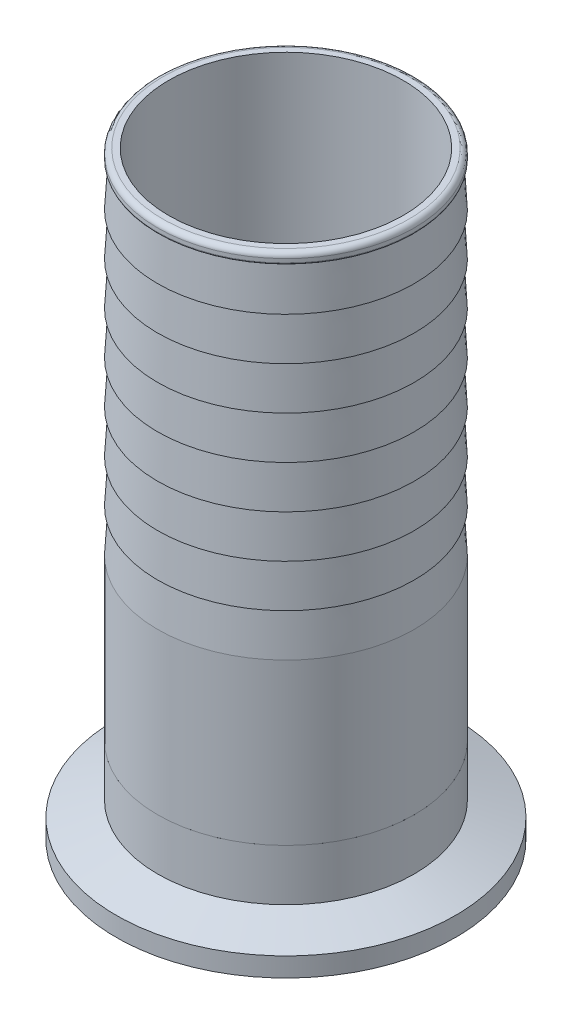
ISO-10303-21;
HEADER;
FILE_DESCRIPTION(('STEP AP214'),'2;1');
FILE_NAME('part.step','',(''),(''),'','','');
FILE_SCHEMA(('AUTOMOTIVE_DESIGN { 1 0 10303 214 1 1 1 1 }'));
ENDSEC;
DATA;
#1=APPLICATION_CONTEXT('core data for automotive mechanical design processes');
#2=APPLICATION_PROTOCOL_DEFINITION('international standard','automotive_design',2000,#1);
#3=PRODUCT_CONTEXT('',#1,'mechanical');
#4=PRODUCT('Part','Part','',(#3));
#5=PRODUCT_RELATED_PRODUCT_CATEGORY('part','',(#4));
#6=PRODUCT_DEFINITION_FORMATION('','',#4);
#7=PRODUCT_DEFINITION_CONTEXT('part definition',#1,'design');
#8=PRODUCT_DEFINITION('design','',#6,#7);
#9=PRODUCT_DEFINITION_SHAPE('','',#8);
#10=(LENGTH_UNIT() NAMED_UNIT(*) SI_UNIT(.MILLI.,.METRE.));
#11=(NAMED_UNIT(*) PLANE_ANGLE_UNIT() SI_UNIT($,.RADIAN.));
#12=(NAMED_UNIT(*) SI_UNIT($,.STERADIAN.) SOLID_ANGLE_UNIT());
#13=UNCERTAINTY_MEASURE_WITH_UNIT(LENGTH_MEASURE(1.E-05),#10,'distance_accuracy_value','');
#14=(GEOMETRIC_REPRESENTATION_CONTEXT(3) GLOBAL_UNCERTAINTY_ASSIGNED_CONTEXT((#13)) GLOBAL_UNIT_ASSIGNED_CONTEXT((#10,
#11,#12)) REPRESENTATION_CONTEXT('',''));
#15=CARTESIAN_POINT('',(0.,0.,0.));
#16=DIRECTION('',(0.,0.,1.));
#17=DIRECTION('',(1.,0.,0.));
#18=AXIS2_PLACEMENT_3D('',#15,#16,#17);
#19=CARTESIAN_POINT('',(19.6952862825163,20.7811026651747,42.6312583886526));
#20=DIRECTION('',(0.,1.00000000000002,0.));
#21=DIRECTION('',(0.,0.,1.00000000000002));
#22=AXIS2_PLACEMENT_3D('',#19,#20,#21);
#23=CONICAL_SURFACE('',#22,20.9336326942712,0.401425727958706);
#24=CARTESIAN_POINT('',(19.6952862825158,20.2613665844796,42.6312583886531));
#25=DIRECTION('',(0.,-1.00000000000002,0.));
#26=DIRECTION('',(0.,0.,-1.00000000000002));
#27=AXIS2_PLACEMENT_3D('',#24,#25,#26);
#28=CIRCLE('',#27,20.7130178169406);
#29=CARTESIAN_POINT('',(19.6952862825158,20.2613665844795,21.9182405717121));
#30=VERTEX_POINT('',#29);
#31=EDGE_CURVE('P0_E10',#30,#30,#28,.T.);
#32=ORIENTED_EDGE('',*,*,#31,.F.);
#33=EDGE_LOOP('',(#32));
#34=FACE_BOUND('',#33,.T.);
#35=CARTESIAN_POINT('',(19.6952862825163,20.7811026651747,42.6312583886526));
#36=DIRECTION('',(0.,-1.00000000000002,0.));
#37=DIRECTION('',(0.,0.,-1.00000000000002));
#38=AXIS2_PLACEMENT_3D('',#35,#36,#37);
#39=CIRCLE('',#38,20.9336326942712);
#40=CARTESIAN_POINT('',(19.6952862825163,20.7811026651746,21.6976256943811));
#41=VERTEX_POINT('',#40);
#42=EDGE_CURVE('P0_E55',#41,#41,#39,.T.);
#43=ORIENTED_EDGE('',*,*,#42,.T.);
#44=EDGE_LOOP('',(#43));
#45=FACE_BOUND('',#44,.T.);
#46=ADVANCED_FACE('P0_F15',(#34,#45),#23,.T.);
#47=CARTESIAN_POINT('',(19.6952862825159,20.5591037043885,42.6312583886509));
#48=DIRECTION('',(0.,-1.00000000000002,0.));
#49=DIRECTION('',(0.,0.,-1.00000000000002));
#50=AXIS2_PLACEMENT_3D('',#47,#48,#49);
#51=TOROIDAL_SURFACE('',#50,20.0115931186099,0.761999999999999);
#52=CARTESIAN_POINT('',(19.695286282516,19.7971037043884,42.6312583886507));
#53=DIRECTION('',(0.,-1.00000000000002,0.));
#54=DIRECTION('',(0.,0.,-1.00000000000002));
#55=AXIS2_PLACEMENT_3D('',#52,#53,#54);
#56=CIRCLE('',#55,20.0115931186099);
#57=CARTESIAN_POINT('',(19.6952862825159,19.7971037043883,22.6196652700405));
#58=VERTEX_POINT('',#57);
#59=EDGE_CURVE('P0_E21',#58,#58,#56,.T.);
#60=ORIENTED_EDGE('',*,*,#59,.F.);
#61=EDGE_LOOP('',(#60));
#62=FACE_BOUND('',#61,.T.);
#63=ORIENTED_EDGE('',*,*,#31,.T.);
#64=EDGE_LOOP('',(#63));
#65=FACE_BOUND('',#64,.T.);
#66=ADVANCED_FACE('P0_F85',(#62,#65),#51,.T.);
#67=CARTESIAN_POINT('',(19.695286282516,19.7971037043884,42.6312583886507));
#68=DIRECTION('',(0.,1.00000000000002,0.));
#69=DIRECTION('',(0.,0.,1.00000000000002));
#70=AXIS2_PLACEMENT_3D('',#67,#68,#69);
#71=PLANE('',#70);
#72=CARTESIAN_POINT('',(19.695286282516,19.7971037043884,42.6312583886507));
#73=DIRECTION('',(0.,-1.00000000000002,0.));
#74=DIRECTION('',(0.,0.,-1.00000000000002));
#75=AXIS2_PLACEMENT_3D('',#72,#73,#74);
#76=CIRCLE('',#75,17.399);
#77=CARTESIAN_POINT('',(19.695286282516,19.7971037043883,25.2322583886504));
#78=VERTEX_POINT('',#77);
#79=EDGE_CURVE('P0_E25',#78,#78,#76,.T.);
#80=ORIENTED_EDGE('',*,*,#79,.F.);
#81=EDGE_LOOP('',(#80));
#82=FACE_BOUND('',#81,.T.);
#83=ORIENTED_EDGE('',*,*,#59,.T.);
#84=EDGE_LOOP('',(#83));
#85=FACE_BOUND('',#84,.T.);
#86=ADVANCED_FACE('P0_F90',(#82,#85),#71,.F.);
#87=CARTESIAN_POINT('',(19.695286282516,19.7971037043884,42.6312583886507));
#88=DIRECTION('',(0.,-1.00000000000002,0.));
#89=DIRECTION('',(0.,0.,-1.00000000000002));
#90=AXIS2_PLACEMENT_3D('',#87,#88,#89);
#91=CYLINDRICAL_SURFACE('',#90,17.399);
#92=ORIENTED_EDGE('',*,*,#79,.T.);
#93=EDGE_LOOP('',(#92));
#94=FACE_BOUND('',#93,.T.);
#95=CARTESIAN_POINT('',(19.6952862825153,32.4971037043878,42.631258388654));
#96=DIRECTION('',(0.,-1.00000000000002,0.));
#97=DIRECTION('',(0.,0.,-1.00000000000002));
#98=AXIS2_PLACEMENT_3D('',#95,#96,#97);
#99=CIRCLE('',#98,17.399);
#100=CARTESIAN_POINT('',(19.6952862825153,32.4971037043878,25.2322583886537));
#101=VERTEX_POINT('',#100);
#102=EDGE_CURVE('P0_E29',#101,#101,#99,.T.);
#103=ORIENTED_EDGE('',*,*,#102,.F.);
#104=EDGE_LOOP('',(#103));
#105=FACE_BOUND('',#104,.T.);
#106=ADVANCED_FACE('P0_F95',(#94,#105),#91,.F.);
#107=CARTESIAN_POINT('',(19.6952862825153,32.4971037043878,42.631258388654));
#108=DIRECTION('',(0.,-1.00000000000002,0.));
#109=DIRECTION('',(0.,0.,-1.00000000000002));
#110=AXIS2_PLACEMENT_3D('',#107,#108,#109);
#111=PLANE('',#110);
#112=CARTESIAN_POINT('',(19.6952862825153,32.4971037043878,42.631258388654));
#113=DIRECTION('',(0.,-1.00000000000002,0.));
#114=DIRECTION('',(0.,0.,-1.00000000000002));
#115=AXIS2_PLACEMENT_3D('',#112,#113,#114);
#116=CIRCLE('',#115,19.05);
#117=CARTESIAN_POINT('',(19.6952862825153,32.4971037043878,23.5812583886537));
#118=VERTEX_POINT('',#117);
#119=EDGE_CURVE('P0_E34',#118,#118,#116,.T.);
#120=ORIENTED_EDGE('',*,*,#119,.F.);
#121=EDGE_LOOP('',(#120));
#122=FACE_BOUND('',#121,.T.);
#123=ORIENTED_EDGE('',*,*,#102,.T.);
#124=EDGE_LOOP('',(#123));
#125=FACE_BOUND('',#124,.T.);
#126=ADVANCED_FACE('P0_F101',(#122,#125),#111,.F.);
#127=CARTESIAN_POINT('',(19.695286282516,19.7971037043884,42.6312583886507));
#128=DIRECTION('',(0.,-1.00000000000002,0.));
#129=DIRECTION('',(0.,0.,-1.00000000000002));
#130=AXIS2_PLACEMENT_3D('',#127,#128,#129);
#131=CYLINDRICAL_SURFACE('',#130,19.05);
#132=CARTESIAN_POINT('',(19.6952862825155,24.8791559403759,42.6312583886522));
#133=DIRECTION('',(0.,-1.00000000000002,0.));
#134=DIRECTION('',(0.,0.,-1.00000000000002));
#135=AXIS2_PLACEMENT_3D('',#132,#133,#134);
#136=CIRCLE('',#135,19.05);
#137=CARTESIAN_POINT('',(19.6952862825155,24.8791559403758,23.5812583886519));
#138=VERTEX_POINT('',#137);
#139=EDGE_CURVE('P0_E37',#138,#138,#136,.T.);
#140=ORIENTED_EDGE('',*,*,#139,.F.);
#141=EDGE_LOOP('',(#140));
#142=FACE_BOUND('',#141,.T.);
#143=ORIENTED_EDGE('',*,*,#119,.T.);
#144=EDGE_LOOP('',(#143));
#145=FACE_BOUND('',#144,.T.);
#146=ADVANCED_FACE('P0_F105',(#142,#145),#131,.T.);
#147=CARTESIAN_POINT('',(19.6952862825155,24.8791559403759,42.6312583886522));
#148=DIRECTION('',(0.,-1.00000000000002,0.));
#149=DIRECTION('',(0.,0.,-1.00000000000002));
#150=AXIS2_PLACEMENT_3D('',#147,#148,#149);
#151=CONICAL_SURFACE('',#150,19.05,1.22173047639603);
#152=CARTESIAN_POINT('',(19.6952862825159,22.6419037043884,42.6312583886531));
#153=DIRECTION('',(0.,-1.00000000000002,0.));
#154=DIRECTION('',(0.,0.,-1.00000000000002));
#155=AXIS2_PLACEMENT_3D('',#152,#153,#154);
#156=CIRCLE('',#155,25.1968);
#157=CARTESIAN_POINT('',(19.6952862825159,22.6419037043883,17.4344583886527));
#158=VERTEX_POINT('',#157);
#159=EDGE_CURVE('P0_E40',#158,#158,#156,.T.);
#160=ORIENTED_EDGE('',*,*,#159,.F.);
#161=EDGE_LOOP('',(#160));
#162=FACE_BOUND('',#161,.T.);
#163=ORIENTED_EDGE('',*,*,#139,.T.);
#164=EDGE_LOOP('',(#163));
#165=FACE_BOUND('',#164,.T.);
#166=ADVANCED_FACE('P0_F109',(#162,#165),#151,.T.);
#167=CARTESIAN_POINT('',(19.695286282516,19.7971037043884,42.6312583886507));
#168=DIRECTION('',(0.,-1.00000000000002,0.));
#169=DIRECTION('',(0.,0.,-1.00000000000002));
#170=AXIS2_PLACEMENT_3D('',#167,#168,#169);
#171=CYLINDRICAL_SURFACE('',#170,25.1968);
#172=CARTESIAN_POINT('',(19.695286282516,19.7971037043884,42.6312583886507));
#173=DIRECTION('',(0.,-1.00000000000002,0.));
#174=DIRECTION('',(0.,0.,-1.00000000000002));
#175=AXIS2_PLACEMENT_3D('',#172,#173,#174);
#176=CIRCLE('',#175,25.1968);
#177=CARTESIAN_POINT('',(19.6952862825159,19.7971037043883,17.4344583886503));
#178=VERTEX_POINT('',#177);
#179=EDGE_CURVE('P0_E43',#178,#178,#176,.T.);
#180=ORIENTED_EDGE('',*,*,#179,.F.);
#181=EDGE_LOOP('',(#180));
#182=FACE_BOUND('',#181,.T.);
#183=ORIENTED_EDGE('',*,*,#159,.T.);
#184=EDGE_LOOP('',(#183));
#185=FACE_BOUND('',#184,.T.);
#186=ADVANCED_FACE('P0_F81',(#182,#185),#171,.T.);
#187=CARTESIAN_POINT('',(19.695286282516,19.7971037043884,42.6312583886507));
#188=DIRECTION('',(0.,1.00000000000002,0.));
#189=DIRECTION('',(0.,0.,1.00000000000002));
#190=AXIS2_PLACEMENT_3D('',#187,#188,#189);
#191=PLANE('',#190);
#192=CARTESIAN_POINT('',(19.695286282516,19.7971037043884,42.6312583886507));
#193=DIRECTION('',(0.,-1.00000000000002,0.));
#194=DIRECTION('',(0.,0.,-1.00000000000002));
#195=AXIS2_PLACEMENT_3D('',#192,#193,#194);
#196=CIRCLE('',#195,23.9521599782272);
#197=CARTESIAN_POINT('',(19.6952862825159,19.7971037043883,18.6790984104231));
#198=VERTEX_POINT('',#197);
#199=EDGE_CURVE('P0_E46',#198,#198,#196,.T.);
#200=ORIENTED_EDGE('',*,*,#199,.F.);
#201=EDGE_LOOP('',(#200));
#202=FACE_BOUND('',#201,.T.);
#203=ORIENTED_EDGE('',*,*,#179,.T.);
#204=EDGE_LOOP('',(#203));
#205=FACE_BOUND('',#204,.T.);
#206=ADVANCED_FACE('P0_F74',(#202,#205),#191,.F.);
#207=CARTESIAN_POINT('',(19.6952862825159,20.5591037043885,42.6312583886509));
#208=DIRECTION('',(0.,-1.00000000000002,0.));
#209=DIRECTION('',(0.,0.,-1.00000000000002));
#210=AXIS2_PLACEMENT_3D('',#207,#208,#209);
#211=TOROIDAL_SURFACE('',#210,23.9521599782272,0.761999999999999);
#212=ORIENTED_EDGE('',*,*,#199,.T.);
#213=EDGE_LOOP('',(#212));
#214=FACE_BOUND('',#213,.T.);
#215=CARTESIAN_POINT('',(19.6952862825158,20.2613665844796,42.6312583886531));
#216=DIRECTION('',(0.,-1.00000000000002,0.));
#217=DIRECTION('',(0.,0.,-1.00000000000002));
#218=AXIS2_PLACEMENT_3D('',#215,#216,#217);
#219=CIRCLE('',#218,23.2507352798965);
#220=CARTESIAN_POINT('',(19.6952862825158,20.2613665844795,19.3805231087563));
#221=VERTEX_POINT('',#220);
#222=EDGE_CURVE('P0_E49',#221,#221,#219,.T.);
#223=ORIENTED_EDGE('',*,*,#222,.F.);
#224=EDGE_LOOP('',(#223));
#225=FACE_BOUND('',#224,.T.);
#226=ADVANCED_FACE('P0_F69',(#214,#225),#211,.T.);
#227=CARTESIAN_POINT('',(19.6952862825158,20.2613665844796,42.6312583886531));
#228=DIRECTION('',(0.,-1.00000000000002,0.));
#229=DIRECTION('',(0.,0.,-1.00000000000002));
#230=AXIS2_PLACEMENT_3D('',#227,#228,#229);
#231=CONICAL_SURFACE('',#230,23.2507352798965,0.401425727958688);
#232=CARTESIAN_POINT('',(19.695286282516,20.6699585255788,42.6312583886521));
#233=DIRECTION('',(0.,-1.00000000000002,0.));
#234=DIRECTION('',(0.,0.,-1.00000000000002));
#235=AXIS2_PLACEMENT_3D('',#232,#233,#234);
#236=CIRCLE('',#235,23.0772982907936);
#237=CARTESIAN_POINT('',(19.695286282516,20.6699585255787,19.5539600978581));
#238=VERTEX_POINT('',#237);
#239=EDGE_CURVE('P0_E52',#238,#238,#236,.T.);
#240=ORIENTED_EDGE('',*,*,#239,.F.);
#241=EDGE_LOOP('',(#240));
#242=FACE_BOUND('',#241,.T.);
#243=ORIENTED_EDGE('',*,*,#222,.T.);
#244=EDGE_LOOP('',(#243));
#245=FACE_BOUND('',#244,.T.);
#246=ADVANCED_FACE('P0_F63',(#242,#245),#231,.F.);
#247=CARTESIAN_POINT('',(19.6952862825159,20.2035037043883,42.6312583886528));
#248=DIRECTION('',(0.,-1.00000000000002,0.));
#249=DIRECTION('',(0.,0.,-1.00000000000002));
#250=AXIS2_PLACEMENT_3D('',#247,#248,#249);
#251=TOROIDAL_SURFACE('',#250,21.9783995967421,1.1938);
#252=ORIENTED_EDGE('',*,*,#42,.F.);
#253=EDGE_LOOP('',(#252));
#254=FACE_BOUND('',#253,.T.);
#255=ORIENTED_EDGE('',*,*,#239,.T.);
#256=EDGE_LOOP('',(#255));
#257=FACE_BOUND('',#256,.T.);
#258=ADVANCED_FACE('P0_F60',(#254,#257),#251,.F.);
#259=CLOSED_SHELL('',(#46,#66,#86,#106,#126,#146,#166,#186,#206,#226,#246,#258));
#260=MANIFOLD_SOLID_BREP('P0_B1',#259);
#261=CARTESIAN_POINT('',(34.5565644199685,32.497103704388,30.7129987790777));
#262=DIRECTION('',(0.,-1.,0.));
#263=DIRECTION('',(-0.625630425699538,0.,-0.780119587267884));
#264=AXIS2_PLACEMENT_3D('',#261,#262,#263);
#265=PLANE('',#264);
#266=CARTESIAN_POINT('',(19.6952862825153,32.4971037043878,42.631258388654));
#267=DIRECTION('',(0.,-1.,0.));
#268=DIRECTION('',(-0.625630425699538,0.,-0.780119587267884));
#269=AXIS2_PLACEMENT_3D('',#266,#267,#268);
#270=CIRCLE('',#269,17.399);
#271=CARTESIAN_POINT('',(8.80994250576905,32.4971037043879,29.0579576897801));
#272=VERTEX_POINT('',#271);
#273=EDGE_CURVE('P1_E85',#272,#272,#270,.T.);
#274=ORIENTED_EDGE('',*,*,#273,.F.);
#275=EDGE_LOOP('',(#274));
#276=FACE_BOUND('',#275,.T.);
#277=CARTESIAN_POINT('',(19.6952862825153,32.4971037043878,42.631258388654));
#278=DIRECTION('',(0.,-1.,0.));
#279=DIRECTION('',(-0.625630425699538,0.,-0.780119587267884));
#280=AXIS2_PLACEMENT_3D('',#277,#278,#279);
#281=CIRCLE('',#280,19.05);
#282=CARTESIAN_POINT('',(7.7770266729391,32.4971037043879,27.7699802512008));
#283=VERTEX_POINT('',#282);
#284=EDGE_CURVE('P1_E9',#283,#283,#281,.T.);
#285=ORIENTED_EDGE('',*,*,#284,.T.);
#286=EDGE_LOOP('',(#285));
#287=FACE_BOUND('',#286,.T.);
#288=ADVANCED_FACE('P1_F14',(#276,#287),#265,.T.);
#289=CARTESIAN_POINT('',(19.6952862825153,32.4971037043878,42.631258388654));
#290=DIRECTION('',(0.,-1.,0.));
#291=DIRECTION('',(-0.625630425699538,0.,-0.780119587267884));
#292=AXIS2_PLACEMENT_3D('',#289,#290,#291);
#293=CYLINDRICAL_SURFACE('',#292,19.05);
#294=CARTESIAN_POINT('',(19.6952862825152,56.3223037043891,42.6312583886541));
#295=DIRECTION('',(0.,-1.,0.));
#296=DIRECTION('',(-0.625630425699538,0.,-0.780119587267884));
#297=AXIS2_PLACEMENT_3D('',#294,#295,#296);
#298=CIRCLE('',#297,19.05);
#299=CARTESIAN_POINT('',(7.77702667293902,56.3223037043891,27.7699802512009));
#300=VERTEX_POINT('',#299);
#301=EDGE_CURVE('P1_E20',#300,#300,#298,.T.);
#302=ORIENTED_EDGE('',*,*,#301,.T.);
#303=EDGE_LOOP('',(#302));
#304=FACE_BOUND('',#303,.T.);
#305=ORIENTED_EDGE('',*,*,#284,.F.);
#306=EDGE_LOOP('',(#305));
#307=FACE_BOUND('',#306,.T.);
#308=ADVANCED_FACE('P1_F101',(#304,#307),#293,.T.);
#309=CARTESIAN_POINT('',(19.6952862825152,56.3223037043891,42.6312583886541));
#310=DIRECTION('',(0.,-1.,0.));
#311=DIRECTION('',(-0.625630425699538,0.,-0.780119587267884));
#312=AXIS2_PLACEMENT_3D('',#309,#310,#311);
#313=CONICAL_SURFACE('',#312,19.05,0.05992815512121);
#314=CARTESIAN_POINT('',(19.6952862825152,62.6723037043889,42.6312583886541));
#315=DIRECTION('',(0.,-1.,0.));
#316=DIRECTION('',(-0.625630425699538,0.,-0.780119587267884));
#317=AXIS2_PLACEMENT_3D('',#314,#315,#316);
#318=CIRCLE('',#317,18.669);
#319=CARTESIAN_POINT('',(8.01539186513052,62.6723037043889,28.06720581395));
#320=VERTEX_POINT('',#319);
#321=EDGE_CURVE('P1_E24',#320,#320,#318,.T.);
#322=ORIENTED_EDGE('',*,*,#321,.T.);
#323=EDGE_LOOP('',(#322));
#324=FACE_BOUND('',#323,.T.);
#325=ORIENTED_EDGE('',*,*,#301,.F.);
#326=EDGE_LOOP('',(#325));
#327=FACE_BOUND('',#326,.T.);
#328=ADVANCED_FACE('P1_F106',(#324,#327),#313,.T.);
#329=CARTESIAN_POINT('',(34.5565644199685,62.672303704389,30.7129987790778));
#330=DIRECTION('',(0.,-1.,0.));
#331=DIRECTION('',(-0.625630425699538,0.,-0.780119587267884));
#332=AXIS2_PLACEMENT_3D('',#329,#330,#331);
#333=PLANE('',#332);
#334=CARTESIAN_POINT('',(19.6952862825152,62.6723037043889,42.6312583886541));
#335=DIRECTION('',(0.,-1.,0.));
#336=DIRECTION('',(-0.625630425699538,0.,-0.780119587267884));
#337=AXIS2_PLACEMENT_3D('',#334,#335,#336);
#338=CIRCLE('',#337,19.05);
#339=CARTESIAN_POINT('',(7.777026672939,62.6723037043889,27.7699802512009));
#340=VERTEX_POINT('',#339);
#341=EDGE_CURVE('P1_E28',#340,#340,#338,.T.);
#342=ORIENTED_EDGE('',*,*,#341,.T.);
#343=EDGE_LOOP('',(#342));
#344=FACE_BOUND('',#343,.T.);
#345=ORIENTED_EDGE('',*,*,#321,.F.);
#346=EDGE_LOOP('',(#345));
#347=FACE_BOUND('',#346,.T.);
#348=ADVANCED_FACE('P1_F110',(#344,#347),#333,.T.);
#349=CARTESIAN_POINT('',(19.6952862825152,62.6723037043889,42.6312583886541));
#350=DIRECTION('',(0.,-1.,0.));
#351=DIRECTION('',(-0.625630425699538,0.,-0.780119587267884));
#352=AXIS2_PLACEMENT_3D('',#349,#350,#351);
#353=CONICAL_SURFACE('',#352,19.05,0.05992815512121);
#354=CARTESIAN_POINT('',(19.6952862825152,69.0223037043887,42.6312583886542));
#355=DIRECTION('',(0.,-1.,0.));
#356=DIRECTION('',(-0.625630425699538,0.,-0.780119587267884));
#357=AXIS2_PLACEMENT_3D('',#354,#355,#356);
#358=CIRCLE('',#357,18.669);
#359=CARTESIAN_POINT('',(8.0153918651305,69.0223037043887,28.06720581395));
#360=VERTEX_POINT('',#359);
#361=EDGE_CURVE('P1_E33',#360,#360,#358,.T.);
#362=ORIENTED_EDGE('',*,*,#361,.T.);
#363=EDGE_LOOP('',(#362));
#364=FACE_BOUND('',#363,.T.);
#365=ORIENTED_EDGE('',*,*,#341,.F.);
#366=EDGE_LOOP('',(#365));
#367=FACE_BOUND('',#366,.T.);
#368=ADVANCED_FACE('P1_F117',(#364,#367),#353,.T.);
#369=CARTESIAN_POINT('',(34.5565644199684,69.0223037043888,30.7129987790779));
#370=DIRECTION('',(0.,-1.,0.));
#371=DIRECTION('',(-0.625630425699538,0.,-0.780119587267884));
#372=AXIS2_PLACEMENT_3D('',#369,#370,#371);
#373=PLANE('',#372);
#374=CARTESIAN_POINT('',(19.6952862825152,69.0223037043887,42.6312583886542));
#375=DIRECTION('',(0.,-1.,0.));
#376=DIRECTION('',(-0.625630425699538,0.,-0.780119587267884));
#377=AXIS2_PLACEMENT_3D('',#374,#375,#376);
#378=CIRCLE('',#377,19.05);
#379=CARTESIAN_POINT('',(7.77702667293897,69.0223037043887,27.769980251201));
#380=VERTEX_POINT('',#379);
#381=EDGE_CURVE('P1_E36',#380,#380,#378,.T.);
#382=ORIENTED_EDGE('',*,*,#381,.T.);
#383=EDGE_LOOP('',(#382));
#384=FACE_BOUND('',#383,.T.);
#385=ORIENTED_EDGE('',*,*,#361,.F.);
#386=EDGE_LOOP('',(#385));
#387=FACE_BOUND('',#386,.T.);
#388=ADVANCED_FACE('P1_F121',(#384,#387),#373,.T.);
#389=CARTESIAN_POINT('',(19.6952862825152,69.0223037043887,42.6312583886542));
#390=DIRECTION('',(0.,-1.,0.));
#391=DIRECTION('',(-0.625630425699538,0.,-0.780119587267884));
#392=AXIS2_PLACEMENT_3D('',#389,#390,#391);
#393=CONICAL_SURFACE('',#392,19.05,0.0599281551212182);
#394=CARTESIAN_POINT('',(19.6952862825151,75.3723037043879,42.6312583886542));
#395=DIRECTION('',(0.,-1.,0.));
#396=DIRECTION('',(-0.625630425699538,0.,-0.780119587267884));
#397=AXIS2_PLACEMENT_3D('',#394,#395,#396);
#398=CIRCLE('',#397,18.669);
#399=CARTESIAN_POINT('',(8.01539186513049,75.3723037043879,28.0672058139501));
#400=VERTEX_POINT('',#399);
#401=EDGE_CURVE('P1_E39',#400,#400,#398,.T.);
#402=ORIENTED_EDGE('',*,*,#401,.T.);
#403=EDGE_LOOP('',(#402));
#404=FACE_BOUND('',#403,.T.);
#405=ORIENTED_EDGE('',*,*,#381,.F.);
#406=EDGE_LOOP('',(#405));
#407=FACE_BOUND('',#406,.T.);
#408=ADVANCED_FACE('P1_F125',(#404,#407),#393,.T.);
#409=CARTESIAN_POINT('',(34.5565644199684,75.3723037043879,30.7129987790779));
#410=DIRECTION('',(0.,-1.,0.));
#411=DIRECTION('',(-0.625630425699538,0.,-0.780119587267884));
#412=AXIS2_PLACEMENT_3D('',#409,#410,#411);
#413=PLANE('',#412);
#414=CARTESIAN_POINT('',(19.6952862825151,75.3723037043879,42.6312583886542));
#415=DIRECTION('',(0.,-1.,0.));
#416=DIRECTION('',(-0.625630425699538,0.,-0.780119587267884));
#417=AXIS2_PLACEMENT_3D('',#414,#415,#416);
#418=CIRCLE('',#417,19.05);
#419=CARTESIAN_POINT('',(7.77702667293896,75.3723037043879,27.769980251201));
#420=VERTEX_POINT('',#419);
#421=EDGE_CURVE('P1_E42',#420,#420,#418,.T.);
#422=ORIENTED_EDGE('',*,*,#421,.T.);
#423=EDGE_LOOP('',(#422));
#424=FACE_BOUND('',#423,.T.);
#425=ORIENTED_EDGE('',*,*,#401,.F.);
#426=EDGE_LOOP('',(#425));
#427=FACE_BOUND('',#426,.T.);
#428=ADVANCED_FACE('P1_F129',(#424,#427),#413,.T.);
#429=CARTESIAN_POINT('',(19.6952862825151,75.3723037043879,42.6312583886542));
#430=DIRECTION('',(0.,-1.,0.));
#431=DIRECTION('',(-0.625630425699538,0.,-0.780119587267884));
#432=AXIS2_PLACEMENT_3D('',#429,#430,#431);
#433=CONICAL_SURFACE('',#432,19.05,0.0599281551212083);
#434=CARTESIAN_POINT('',(19.6952862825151,81.7223037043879,42.6312583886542));
#435=DIRECTION('',(0.,-1.,0.));
#436=DIRECTION('',(-0.625630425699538,0.,-0.780119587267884));
#437=AXIS2_PLACEMENT_3D('',#434,#435,#436);
#438=CIRCLE('',#437,18.669);
#439=CARTESIAN_POINT('',(8.01539186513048,81.7223037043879,28.0672058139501));
#440=VERTEX_POINT('',#439);
#441=EDGE_CURVE('P1_E45',#440,#440,#438,.T.);
#442=ORIENTED_EDGE('',*,*,#441,.T.);
#443=EDGE_LOOP('',(#442));
#444=FACE_BOUND('',#443,.T.);
#445=ORIENTED_EDGE('',*,*,#421,.F.);
#446=EDGE_LOOP('',(#445));
#447=FACE_BOUND('',#446,.T.);
#448=ADVANCED_FACE('P1_F133',(#444,#447),#433,.T.);
#449=CARTESIAN_POINT('',(34.5565644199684,81.7223037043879,30.712998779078));
#450=DIRECTION('',(0.,-1.,0.));
#451=DIRECTION('',(-0.625630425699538,0.,-0.780119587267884));
#452=AXIS2_PLACEMENT_3D('',#449,#450,#451);
#453=PLANE('',#452);
#454=CARTESIAN_POINT('',(19.6952862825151,81.7223037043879,42.6312583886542));
#455=DIRECTION('',(0.,-1.,0.));
#456=DIRECTION('',(-0.625630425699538,0.,-0.780119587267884));
#457=AXIS2_PLACEMENT_3D('',#454,#455,#456);
#458=CIRCLE('',#457,19.05);
#459=CARTESIAN_POINT('',(7.77702667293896,81.7223037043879,27.769980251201));
#460=VERTEX_POINT('',#459);
#461=EDGE_CURVE('P1_E48',#460,#460,#458,.T.);
#462=ORIENTED_EDGE('',*,*,#461,.T.);
#463=EDGE_LOOP('',(#462));
#464=FACE_BOUND('',#463,.T.);
#465=ORIENTED_EDGE('',*,*,#441,.F.);
#466=EDGE_LOOP('',(#465));
#467=FACE_BOUND('',#466,.T.);
#468=ADVANCED_FACE('P1_F137',(#464,#467),#453,.T.);
#469=CARTESIAN_POINT('',(19.6952862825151,81.7223037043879,42.6312583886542));
#470=DIRECTION('',(0.,-1.,0.));
#471=DIRECTION('',(-0.625630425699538,0.,-0.780119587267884));
#472=AXIS2_PLACEMENT_3D('',#469,#470,#471);
#473=CONICAL_SURFACE('',#472,19.05,0.0599281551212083);
#474=CARTESIAN_POINT('',(19.6952862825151,88.0723037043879,42.6312583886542));
#475=DIRECTION('',(0.,-1.,0.));
#476=DIRECTION('',(-0.625630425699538,0.,-0.780119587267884));
#477=AXIS2_PLACEMENT_3D('',#474,#475,#476);
#478=CIRCLE('',#477,18.669);
#479=CARTESIAN_POINT('',(8.01539186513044,88.0723037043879,28.0672058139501));
#480=VERTEX_POINT('',#479);
#481=EDGE_CURVE('P1_E51',#480,#480,#478,.T.);
#482=ORIENTED_EDGE('',*,*,#481,.T.);
#483=EDGE_LOOP('',(#482));
#484=FACE_BOUND('',#483,.T.);
#485=ORIENTED_EDGE('',*,*,#461,.F.);
#486=EDGE_LOOP('',(#485));
#487=FACE_BOUND('',#486,.T.);
#488=ADVANCED_FACE('P1_F141',(#484,#487),#473,.T.);
#489=CARTESIAN_POINT('',(34.5565644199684,88.072303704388,30.712998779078));
#490=DIRECTION('',(0.,-1.,0.));
#491=DIRECTION('',(-0.625630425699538,0.,-0.780119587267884));
#492=AXIS2_PLACEMENT_3D('',#489,#490,#491);
#493=PLANE('',#492);
#494=CARTESIAN_POINT('',(19.6952862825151,88.0723037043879,42.6312583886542));
#495=DIRECTION('',(0.,-1.,0.));
#496=DIRECTION('',(-0.625630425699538,0.,-0.780119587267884));
#497=AXIS2_PLACEMENT_3D('',#494,#495,#496);
#498=CIRCLE('',#497,19.05);
#499=CARTESIAN_POINT('',(7.77702667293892,88.0723037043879,27.7699802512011));
#500=VERTEX_POINT('',#499);
#501=EDGE_CURVE('P1_E54',#500,#500,#498,.T.);
#502=ORIENTED_EDGE('',*,*,#501,.T.);
#503=EDGE_LOOP('',(#502));
#504=FACE_BOUND('',#503,.T.);
#505=ORIENTED_EDGE('',*,*,#481,.F.);
#506=EDGE_LOOP('',(#505));
#507=FACE_BOUND('',#506,.T.);
#508=ADVANCED_FACE('P1_F145',(#504,#507),#493,.T.);
#509=CARTESIAN_POINT('',(19.6952862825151,88.0723037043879,42.6312583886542));
#510=DIRECTION('',(0.,-1.,0.));
#511=DIRECTION('',(-0.625630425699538,0.,-0.780119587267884));
#512=AXIS2_PLACEMENT_3D('',#509,#510,#511);
#513=CONICAL_SURFACE('',#512,19.05,0.0599281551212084);
#514=CARTESIAN_POINT('',(19.6952862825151,94.4223037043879,42.6312583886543));
#515=DIRECTION('',(0.,-1.,0.));
#516=DIRECTION('',(-0.625630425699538,0.,-0.780119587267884));
#517=AXIS2_PLACEMENT_3D('',#514,#515,#516);
#518=CIRCLE('',#517,18.669);
#519=CARTESIAN_POINT('',(8.01539186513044,94.4223037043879,28.0672058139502));
#520=VERTEX_POINT('',#519);
#521=EDGE_CURVE('P1_E57',#520,#520,#518,.T.);
#522=ORIENTED_EDGE('',*,*,#521,.T.);
#523=EDGE_LOOP('',(#522));
#524=FACE_BOUND('',#523,.T.);
#525=ORIENTED_EDGE('',*,*,#501,.F.);
#526=EDGE_LOOP('',(#525));
#527=FACE_BOUND('',#526,.T.);
#528=ADVANCED_FACE('P1_F149',(#524,#527),#513,.T.);
#529=CARTESIAN_POINT('',(34.5565644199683,94.422303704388,30.712998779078));
#530=DIRECTION('',(0.,-1.,0.));
#531=DIRECTION('',(-0.625630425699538,0.,-0.780119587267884));
#532=AXIS2_PLACEMENT_3D('',#529,#530,#531);
#533=PLANE('',#532);
#534=CARTESIAN_POINT('',(19.6952862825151,94.4223037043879,42.6312583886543));
#535=DIRECTION('',(0.,-1.,0.));
#536=DIRECTION('',(-0.625630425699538,0.,-0.780119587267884));
#537=AXIS2_PLACEMENT_3D('',#534,#535,#536);
#538=CIRCLE('',#537,19.05);
#539=CARTESIAN_POINT('',(7.77702667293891,94.4223037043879,27.7699802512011));
#540=VERTEX_POINT('',#539);
#541=EDGE_CURVE('P1_E60',#540,#540,#538,.T.);
#542=ORIENTED_EDGE('',*,*,#541,.T.);
#543=EDGE_LOOP('',(#542));
#544=FACE_BOUND('',#543,.T.);
#545=ORIENTED_EDGE('',*,*,#521,.F.);
#546=EDGE_LOOP('',(#545));
#547=FACE_BOUND('',#546,.T.);
#548=ADVANCED_FACE('P1_F153',(#544,#547),#533,.T.);
#549=CARTESIAN_POINT('',(19.6952862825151,94.4223037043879,42.6312583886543));
#550=DIRECTION('',(0.,-1.,0.));
#551=DIRECTION('',(-0.625630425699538,0.,-0.780119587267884));
#552=AXIS2_PLACEMENT_3D('',#549,#550,#551);
#553=CONICAL_SURFACE('',#552,19.05,0.0599281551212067);
#554=CARTESIAN_POINT('',(19.6952862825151,100.772303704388,42.6312583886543));
#555=DIRECTION('',(0.,-1.,0.));
#556=DIRECTION('',(-0.625630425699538,0.,-0.780119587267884));
#557=AXIS2_PLACEMENT_3D('',#554,#555,#556);
#558=CIRCLE('',#557,18.669);
#559=CARTESIAN_POINT('',(8.01539186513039,100.772303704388,28.0672058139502));
#560=VERTEX_POINT('',#559);
#561=EDGE_CURVE('P1_E63',#560,#560,#558,.T.);
#562=ORIENTED_EDGE('',*,*,#561,.T.);
#563=EDGE_LOOP('',(#562));
#564=FACE_BOUND('',#563,.T.);
#565=ORIENTED_EDGE('',*,*,#541,.F.);
#566=EDGE_LOOP('',(#565));
#567=FACE_BOUND('',#566,.T.);
#568=ADVANCED_FACE('P1_F157',(#564,#567),#553,.T.);
#569=CARTESIAN_POINT('',(34.5565644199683,100.772303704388,30.712998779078));
#570=DIRECTION('',(0.,-1.,0.));
#571=DIRECTION('',(-0.625630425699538,0.,-0.780119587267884));
#572=AXIS2_PLACEMENT_3D('',#569,#570,#571);
#573=PLANE('',#572);
#574=CARTESIAN_POINT('',(19.6952862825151,100.772303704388,42.6312583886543));
#575=DIRECTION('',(0.,-1.,0.));
#576=DIRECTION('',(-0.625630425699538,0.,-0.780119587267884));
#577=AXIS2_PLACEMENT_3D('',#574,#575,#576);
#578=CIRCLE('',#577,19.05);
#579=CARTESIAN_POINT('',(7.77702667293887,100.772303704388,27.7699802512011));
#580=VERTEX_POINT('',#579);
#581=EDGE_CURVE('P1_E66',#580,#580,#578,.T.);
#582=ORIENTED_EDGE('',*,*,#581,.T.);
#583=EDGE_LOOP('',(#582));
#584=FACE_BOUND('',#583,.T.);
#585=ORIENTED_EDGE('',*,*,#561,.F.);
#586=EDGE_LOOP('',(#585));
#587=FACE_BOUND('',#586,.T.);
#588=ADVANCED_FACE('P1_F161',(#584,#587),#573,.T.);
#589=CARTESIAN_POINT('',(19.6952862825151,100.772303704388,42.6312583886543));
#590=DIRECTION('',(0.,-1.,0.));
#591=DIRECTION('',(-0.625630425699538,0.,-0.780119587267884));
#592=AXIS2_PLACEMENT_3D('',#589,#590,#591);
#593=CONICAL_SURFACE('',#592,19.05,0.0599281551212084);
#594=CARTESIAN_POINT('',(19.695286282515,107.122303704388,42.6312583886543));
#595=DIRECTION('',(0.,-1.,0.));
#596=DIRECTION('',(-0.625630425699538,0.,-0.780119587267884));
#597=AXIS2_PLACEMENT_3D('',#594,#595,#596);
#598=CIRCLE('',#597,18.669);
#599=CARTESIAN_POINT('',(8.01539186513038,107.122303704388,28.0672058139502));
#600=VERTEX_POINT('',#599);
#601=EDGE_CURVE('P1_E69',#600,#600,#598,.T.);
#602=ORIENTED_EDGE('',*,*,#601,.T.);
#603=EDGE_LOOP('',(#602));
#604=FACE_BOUND('',#603,.T.);
#605=ORIENTED_EDGE('',*,*,#581,.F.);
#606=EDGE_LOOP('',(#605));
#607=FACE_BOUND('',#606,.T.);
#608=ADVANCED_FACE('P1_F165',(#604,#607),#593,.T.);
#609=CARTESIAN_POINT('',(34.3584140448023,107.122303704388,30.8719089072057));
#610=DIRECTION('',(0.,-1.,0.));
#611=DIRECTION('',(-0.625630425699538,0.,-0.780119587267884));
#612=AXIS2_PLACEMENT_3D('',#609,#610,#611);
#613=PLANE('',#612);
#614=CARTESIAN_POINT('',(19.695286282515,107.122303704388,42.6312583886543));
#615=DIRECTION('',(0.,-1.,0.));
#616=DIRECTION('',(-0.625630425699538,0.,-0.780119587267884));
#617=AXIS2_PLACEMENT_3D('',#614,#615,#616);
#618=CIRCLE('',#617,18.7960000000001);
#619=CARTESIAN_POINT('',(7.93593680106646,107.122303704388,27.9681306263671));
#620=VERTEX_POINT('',#619);
#621=EDGE_CURVE('P1_E72',#620,#620,#618,.T.);
#622=ORIENTED_EDGE('',*,*,#621,.T.);
#623=EDGE_LOOP('',(#622));
#624=FACE_BOUND('',#623,.T.);
#625=ORIENTED_EDGE('',*,*,#601,.F.);
#626=EDGE_LOOP('',(#625));
#627=FACE_BOUND('',#626,.T.);
#628=ADVANCED_FACE('P1_F169',(#624,#627),#613,.T.);
#629=CARTESIAN_POINT('',(19.695286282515,107.376303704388,42.6312583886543));
#630=DIRECTION('',(0.,-1.,0.));
#631=DIRECTION('',(-0.625630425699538,0.,-0.780119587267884));
#632=AXIS2_PLACEMENT_3D('',#629,#630,#631);
#633=TOROIDAL_SURFACE('',#632,18.796,0.254000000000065);
#634=CARTESIAN_POINT('',(19.695286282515,107.376303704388,42.6312583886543));
#635=DIRECTION('',(0.,-1.,0.));
#636=DIRECTION('',(-0.625630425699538,0.,-0.780119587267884));
#637=AXIS2_PLACEMENT_3D('',#634,#635,#636);
#638=CIRCLE('',#637,19.05);
#639=CARTESIAN_POINT('',(7.77702667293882,107.376303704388,27.7699802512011));
#640=VERTEX_POINT('',#639);
#641=EDGE_CURVE('P1_E75',#640,#640,#638,.T.);
#642=ORIENTED_EDGE('',*,*,#641,.T.);
#643=EDGE_LOOP('',(#642));
#644=FACE_BOUND('',#643,.T.);
#645=ORIENTED_EDGE('',*,*,#621,.F.);
#646=EDGE_LOOP('',(#645));
#647=FACE_BOUND('',#646,.T.);
#648=ADVANCED_FACE('P1_F173',(#644,#647),#633,.T.);
#649=CARTESIAN_POINT('',(19.6952862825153,32.4971037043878,42.631258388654));
#650=DIRECTION('',(0.,-1.,0.));
#651=DIRECTION('',(-0.625630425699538,0.,-0.780119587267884));
#652=AXIS2_PLACEMENT_3D('',#649,#650,#651);
#653=CYLINDRICAL_SURFACE('',#652,19.05);
#654=CARTESIAN_POINT('',(19.6952862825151,107.935103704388,42.6312583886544));
#655=DIRECTION('',(0.,-1.,0.));
#656=DIRECTION('',(-0.625630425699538,0.,-0.780119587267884));
#657=AXIS2_PLACEMENT_3D('',#654,#655,#656);
#658=CIRCLE('',#657,19.05);
#659=CARTESIAN_POINT('',(7.77702667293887,107.935103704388,27.7699802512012));
#660=VERTEX_POINT('',#659);
#661=EDGE_CURVE('P1_E78',#660,#660,#658,.T.);
#662=ORIENTED_EDGE('',*,*,#661,.T.);
#663=EDGE_LOOP('',(#662));
#664=FACE_BOUND('',#663,.T.);
#665=ORIENTED_EDGE('',*,*,#641,.F.);
#666=EDGE_LOOP('',(#665));
#667=FACE_BOUND('',#666,.T.);
#668=ADVANCED_FACE('P1_F177',(#664,#667),#653,.T.);
#669=CARTESIAN_POINT('',(19.6952862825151,107.935103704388,42.6312583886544));
#670=DIRECTION('',(0.,-1.,0.));
#671=DIRECTION('',(-0.625630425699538,0.,-0.780119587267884));
#672=AXIS2_PLACEMENT_3D('',#669,#670,#671);
#673=TOROIDAL_SURFACE('',#672,18.288,0.761999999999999);
#674=CARTESIAN_POINT('',(19.6952862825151,108.697103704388,42.6312583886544));
#675=DIRECTION('',(0.,-1.,0.));
#676=DIRECTION('',(-0.625630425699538,0.,-0.780119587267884));
#677=AXIS2_PLACEMENT_3D('',#674,#675,#676);
#678=CIRCLE('',#677,18.288);
#679=CARTESIAN_POINT('',(8.25375705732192,108.697103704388,28.3644313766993));
#680=VERTEX_POINT('',#679);
#681=EDGE_CURVE('P1_E81',#680,#680,#678,.T.);
#682=ORIENTED_EDGE('',*,*,#681,.T.);
#683=EDGE_LOOP('',(#682));
#684=FACE_BOUND('',#683,.T.);
#685=ORIENTED_EDGE('',*,*,#661,.F.);
#686=EDGE_LOOP('',(#685));
#687=FACE_BOUND('',#686,.T.);
#688=ADVANCED_FACE('P1_F181',(#684,#687),#673,.T.);
#689=CARTESIAN_POINT('',(19.6952862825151,108.697103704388,42.6312583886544));
#690=DIRECTION('',(0.,1.,0.));
#691=DIRECTION('',(0.625630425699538,0.,0.780119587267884));
#692=AXIS2_PLACEMENT_3D('',#689,#690,#691);
#693=PLANE('',#692);
#694=CARTESIAN_POINT('',(19.6952862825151,108.697103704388,42.6312583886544));
#695=DIRECTION('',(0.,-1.,0.));
#696=DIRECTION('',(-0.625630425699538,0.,-0.780119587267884));
#697=AXIS2_PLACEMENT_3D('',#694,#695,#696);
#698=CIRCLE('',#697,17.399);
#699=CARTESIAN_POINT('',(8.8099425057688,108.697103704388,29.0579576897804));
#700=VERTEX_POINT('',#699);
#701=EDGE_CURVE('P1_E84',#700,#700,#698,.T.);
#702=ORIENTED_EDGE('',*,*,#701,.T.);
#703=EDGE_LOOP('',(#702));
#704=FACE_BOUND('',#703,.T.);
#705=ORIENTED_EDGE('',*,*,#681,.F.);
#706=EDGE_LOOP('',(#705));
#707=FACE_BOUND('',#706,.T.);
#708=ADVANCED_FACE('P1_F91',(#704,#707),#693,.T.);
#709=CARTESIAN_POINT('',(19.6952862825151,108.697103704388,42.6312583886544));
#710=DIRECTION('',(0.,-1.,0.));
#711=DIRECTION('',(-0.625630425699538,0.,-0.780119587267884));
#712=AXIS2_PLACEMENT_3D('',#709,#710,#711);
#713=CYLINDRICAL_SURFACE('',#712,17.399);
#714=CARTESIAN_POINT('',(8.8099425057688,108.697103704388,29.0579576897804));
#715=CARTESIAN_POINT('',(8.8099425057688,107.903353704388,29.0579576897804));
#716=CARTESIAN_POINT('',(8.8099425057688,107.109603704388,29.0579576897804));
#717=CARTESIAN_POINT('',(8.80994250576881,105.522103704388,29.0579576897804));
#718=CARTESIAN_POINT('',(8.80994250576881,104.728353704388,29.0579576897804));
#719=CARTESIAN_POINT('',(8.80994250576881,103.140853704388,29.0579576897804));
#720=CARTESIAN_POINT('',(8.80994250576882,102.347103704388,29.0579576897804));
#721=CARTESIAN_POINT('',(8.80994250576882,100.759603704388,29.0579576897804));
#722=CARTESIAN_POINT('',(8.80994250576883,99.9658537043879,29.0579576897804));
#723=CARTESIAN_POINT('',(8.80994250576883,98.3783537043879,29.0579576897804));
#724=CARTESIAN_POINT('',(8.80994250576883,97.5846037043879,29.0579576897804));
#725=CARTESIAN_POINT('',(8.80994250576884,95.9971037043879,29.0579576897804));
#726=CARTESIAN_POINT('',(8.80994250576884,95.2033537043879,29.0579576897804));
#727=CARTESIAN_POINT('',(8.80994250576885,93.6158537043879,29.0579576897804));
#728=CARTESIAN_POINT('',(8.80994250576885,92.8221037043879,29.0579576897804));
#729=CARTESIAN_POINT('',(8.80994250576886,91.2346037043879,29.0579576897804));
#730=CARTESIAN_POINT('',(8.80994250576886,90.4408537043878,29.0579576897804));
#731=CARTESIAN_POINT('',(8.80994250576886,88.8533537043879,29.0579576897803));
#732=CARTESIAN_POINT('',(8.80994250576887,88.0596037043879,29.0579576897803));
#733=CARTESIAN_POINT('',(8.80994250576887,86.4721037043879,29.0579576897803));
#734=CARTESIAN_POINT('',(8.80994250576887,85.6783537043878,29.0579576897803));
#735=CARTESIAN_POINT('',(8.80994250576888,84.0908537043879,29.0579576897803));
#736=CARTESIAN_POINT('',(8.80994250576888,83.2971037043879,29.0579576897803));
#737=CARTESIAN_POINT('',(8.80994250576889,81.7096037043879,29.0579576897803));
#738=CARTESIAN_POINT('',(8.80994250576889,80.9158537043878,29.0579576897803));
#739=CARTESIAN_POINT('',(8.80994250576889,79.3283537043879,29.0579576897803));
#740=CARTESIAN_POINT('',(8.8099425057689,78.5346037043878,29.0579576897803));
#741=CARTESIAN_POINT('',(8.8099425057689,76.9471037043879,29.0579576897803));
#742=CARTESIAN_POINT('',(8.80994250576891,76.1533537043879,29.0579576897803));
#743=CARTESIAN_POINT('',(8.80994250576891,74.5658537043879,29.0579576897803));
#744=CARTESIAN_POINT('',(8.80994250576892,73.7721037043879,29.0579576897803));
#745=CARTESIAN_POINT('',(8.80994250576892,72.1846037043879,29.0579576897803));
#746=CARTESIAN_POINT('',(8.80994250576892,71.3908537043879,29.0579576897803));
#747=CARTESIAN_POINT('',(8.80994250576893,69.8033537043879,29.0579576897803));
#748=CARTESIAN_POINT('',(8.80994250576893,69.0096037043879,29.0579576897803));
#749=CARTESIAN_POINT('',(8.80994250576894,67.4221037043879,29.0579576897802));
#750=CARTESIAN_POINT('',(8.80994250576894,66.6283537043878,29.0579576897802));
#751=CARTESIAN_POINT('',(8.80994250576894,65.0408537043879,29.0579576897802));
#752=CARTESIAN_POINT('',(8.80994250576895,64.2471037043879,29.0579576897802));
#753=CARTESIAN_POINT('',(8.80994250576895,62.6596037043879,29.0579576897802));
#754=CARTESIAN_POINT('',(8.80994250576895,61.8658537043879,29.0579576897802));
#755=CARTESIAN_POINT('',(8.80994250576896,60.2783537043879,29.0579576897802));
#756=CARTESIAN_POINT('',(8.80994250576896,59.4846037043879,29.0579576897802));
#757=CARTESIAN_POINT('',(8.80994250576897,57.8971037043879,29.0579576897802));
#758=CARTESIAN_POINT('',(8.80994250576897,57.1033537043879,29.0579576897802));
#759=CARTESIAN_POINT('',(8.80994250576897,55.5158537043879,29.0579576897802));
#760=CARTESIAN_POINT('',(8.80994250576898,54.7221037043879,29.0579576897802));
#761=CARTESIAN_POINT('',(8.80994250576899,53.1346037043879,29.0579576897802));
#762=CARTESIAN_POINT('',(8.80994250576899,52.3408537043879,29.0579576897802));
#763=CARTESIAN_POINT('',(8.80994250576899,50.7533537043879,29.0579576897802));
#764=CARTESIAN_POINT('',(8.80994250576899,49.9596037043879,29.0579576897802));
#765=CARTESIAN_POINT('',(8.809942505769,48.3721037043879,29.0579576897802));
#766=CARTESIAN_POINT('',(8.809942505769,47.5783537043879,29.0579576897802));
#767=CARTESIAN_POINT('',(8.80994250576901,45.9908537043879,29.0579576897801));
#768=CARTESIAN_POINT('',(8.80994250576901,45.1971037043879,29.0579576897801));
#769=CARTESIAN_POINT('',(8.80994250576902,43.6096037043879,29.0579576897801));
#770=CARTESIAN_POINT('',(8.80994250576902,42.8158537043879,29.0579576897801));
#771=CARTESIAN_POINT('',(8.80994250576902,41.2283537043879,29.0579576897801));
#772=CARTESIAN_POINT('',(8.80994250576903,40.4346037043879,29.0579576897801));
#773=CARTESIAN_POINT('',(8.80994250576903,38.8471037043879,29.0579576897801));
#774=CARTESIAN_POINT('',(8.80994250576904,38.0533537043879,29.0579576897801));
#775=CARTESIAN_POINT('',(8.80994250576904,36.4658537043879,29.0579576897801));
#776=CARTESIAN_POINT('',(8.80994250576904,35.6721037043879,29.0579576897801));
#777=CARTESIAN_POINT('',(8.80994250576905,34.0846037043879,29.0579576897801));
#778=CARTESIAN_POINT('',(8.80994250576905,33.2908537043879,29.0579576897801));
#779=CARTESIAN_POINT('',(8.80994250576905,32.4971037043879,29.0579576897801));
#780=B_SPLINE_CURVE_WITH_KNOTS('',3,(#714,#715,#716,#717,#718,#719,#720,#721,#722,#723,#724,
#725,#726,#727,#728,#729,#730,#731,#732,#733,#734,#735,#736,#737,#738,#739,#740,#741,#742,#743,
#744,#745,#746,#747,#748,#749,#750,#751,#752,#753,#754,#755,#756,#757,#758,#759,#760,#761,#762,
#763,#764,#765,#766,#767,#768,#769,#770,#771,#772,#773,#774,#775,#776,#777,#778,#779),
.UNSPECIFIED.,.F.,.F.,(4,2,2,2,2,2,2,2,2,2,2,2,2,2,2,2,2,2,2,2,2,2,2,2,2,2,2,2,2,2,2,2,4),(0.,
2.38125,4.7625,7.14375,9.52500000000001,11.90625,14.2875,16.66875,19.05,21.43125,23.8125,
26.19375,28.575,30.95625,33.3375,35.71875,38.1,40.48125,42.8625,45.24375,47.625,50.00625,
52.3875,54.76875,57.15,59.53125,61.9125,64.29375,66.675,69.05625,71.4375,73.81875,76.2),.UNSPECIFIED.);
#781=EDGE_CURVE('P1_BSEAM94',#700,#272,#780,.T.);
#782=ORIENTED_EDGE('',*,*,#701,.F.);
#783=ORIENTED_EDGE('',*,*,#273,.T.);
#784=ORIENTED_EDGE('',*,*,#781,.T.);
#785=ORIENTED_EDGE('',*,*,#781,.F.);
#786=EDGE_LOOP('',(#782,#784,#783,#785));
#787=FACE_BOUND('',#786,.T.);
#788=ADVANCED_FACE('P1_F94',(#787),#713,.F.);
#789=CLOSED_SHELL('',(#288,#308,#328,#348,#368,#388,#408,#428,#448,#468,#488,#508,#528,#548,
#568,#588,#608,#628,#648,#668,#688,#708,#788));
#790=MANIFOLD_SOLID_BREP('P1_B1',#789);
#791=ADVANCED_BREP_SHAPE_REPRESENTATION('',(#18,#260,#790),#14);
#792=SHAPE_DEFINITION_REPRESENTATION(#9,#791);
ENDSEC;
END-ISO-10303-21;
